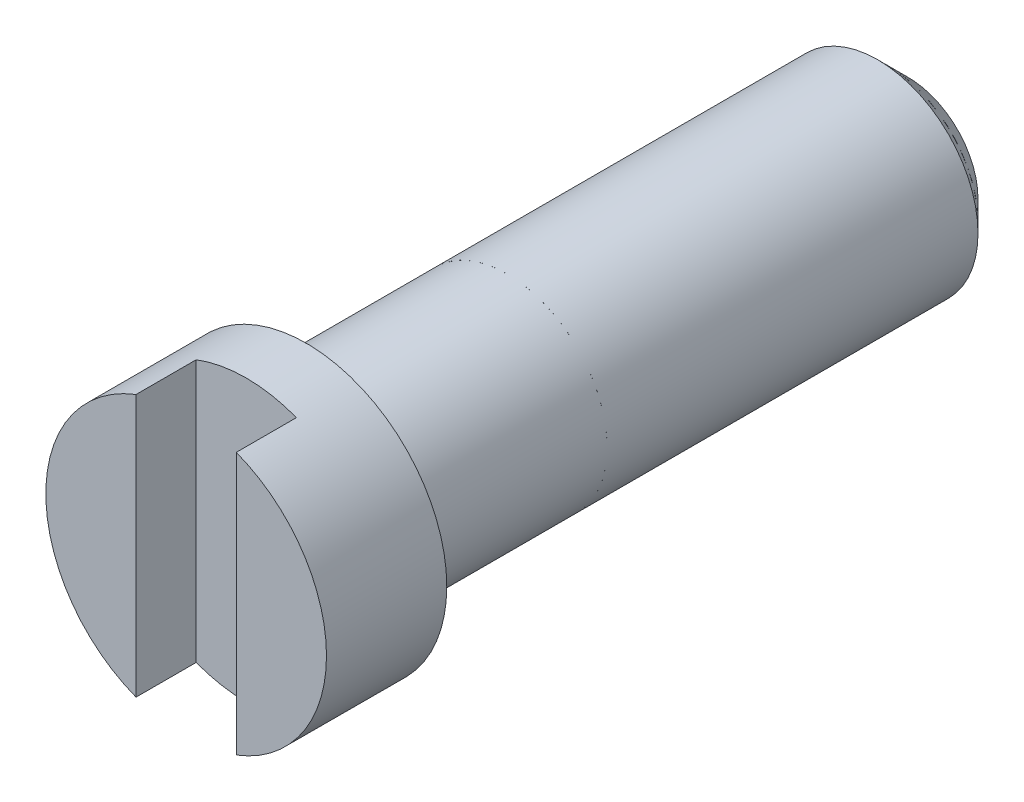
ISO-10303-21;
HEADER;
FILE_DESCRIPTION(('STEP AP214'),'2;1');
FILE_NAME('part.step','',(''),(''),'','','');
FILE_SCHEMA(('AUTOMOTIVE_DESIGN { 1 0 10303 214 1 1 1 1 }'));
ENDSEC;
DATA;
#1=APPLICATION_CONTEXT('core data for automotive mechanical design processes');
#2=APPLICATION_PROTOCOL_DEFINITION('international standard','automotive_design',2000,#1);
#3=PRODUCT_CONTEXT('',#1,'mechanical');
#4=PRODUCT('Part','Part','',(#3));
#5=PRODUCT_RELATED_PRODUCT_CATEGORY('part','',(#4));
#6=PRODUCT_DEFINITION_FORMATION('','',#4);
#7=PRODUCT_DEFINITION_CONTEXT('part definition',#1,'design');
#8=PRODUCT_DEFINITION('design','',#6,#7);
#9=PRODUCT_DEFINITION_SHAPE('','',#8);
#10=(LENGTH_UNIT() NAMED_UNIT(*) SI_UNIT(.MILLI.,.METRE.));
#11=(NAMED_UNIT(*) PLANE_ANGLE_UNIT() SI_UNIT($,.RADIAN.));
#12=(NAMED_UNIT(*) SI_UNIT($,.STERADIAN.) SOLID_ANGLE_UNIT());
#13=UNCERTAINTY_MEASURE_WITH_UNIT(LENGTH_MEASURE(1.E-05),#10,'distance_accuracy_value','');
#14=(GEOMETRIC_REPRESENTATION_CONTEXT(3) GLOBAL_UNCERTAINTY_ASSIGNED_CONTEXT((#13)) GLOBAL_UNIT_ASSIGNED_CONTEXT((#10,
#11,#12)) REPRESENTATION_CONTEXT('',''));
#15=CARTESIAN_POINT('',(0.,0.,0.));
#16=DIRECTION('',(0.,0.,1.));
#17=DIRECTION('',(1.,0.,0.));
#18=AXIS2_PLACEMENT_3D('',#15,#16,#17);
#19=CARTESIAN_POINT('',(0.5,1.68,1.2));
#20=DIRECTION('',(1.,0.,0.));
#21=DIRECTION('',(0.,0.,-1.));
#22=AXIS2_PLACEMENT_3D('',#19,#20,#21);
#23=PLANE('',#22);
#24=DIRECTION('',(0.,1.,0.));
#25=VECTOR('',#24,1.);
#26=CARTESIAN_POINT('',(0.5,1.68,0.6));
#27=LINE('',#26,#25);
#28=CARTESIAN_POINT('',(0.5,1.3076696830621,0.6));
#29=VERTEX_POINT('',#28);
#30=CARTESIAN_POINT('',(0.5,-1.3076696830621,0.6));
#31=VERTEX_POINT('',#30);
#32=EDGE_CURVE('P0_E72',#29,#31,#27,.F.);
#33=ORIENTED_EDGE('',*,*,#32,.T.);
#34=DIRECTION('',(0.,0.,-1.));
#35=VECTOR('',#34,1.);
#36=CARTESIAN_POINT('',(0.5,-1.307669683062,1.2));
#37=LINE('',#36,#35);
#38=CARTESIAN_POINT('',(0.5,-1.3076696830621,1.2));
#39=VERTEX_POINT('',#38);
#40=EDGE_CURVE('P0_E34',#39,#31,#37,.T.);
#41=ORIENTED_EDGE('',*,*,#40,.F.);
#42=DIRECTION('',(0.,1.,0.));
#43=VECTOR('',#42,1.);
#44=CARTESIAN_POINT('',(0.5,0.,1.2));
#45=LINE('',#44,#43);
#46=CARTESIAN_POINT('',(0.5,1.3076696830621,1.2));
#47=VERTEX_POINT('',#46);
#48=EDGE_CURVE('P0_E61',#47,#39,#45,.F.);
#49=ORIENTED_EDGE('',*,*,#48,.F.);
#50=DIRECTION('',(0.,0.,-1.));
#51=VECTOR('',#50,1.);
#52=CARTESIAN_POINT('',(0.5,1.307669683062,1.2));
#53=LINE('',#52,#51);
#54=EDGE_CURVE('P0_E65',#29,#47,#53,.F.);
#55=ORIENTED_EDGE('',*,*,#54,.F.);
#56=EDGE_LOOP('',(#33,#41,#49,#55));
#57=FACE_BOUND('',#56,.T.);
#58=ADVANCED_FACE('P0_F16',(#57),#23,.F.);
#59=CARTESIAN_POINT('',(-0.5,1.68,0.6));
#60=DIRECTION('',(-1.,0.,0.));
#61=DIRECTION('',(0.,0.,1.));
#62=AXIS2_PLACEMENT_3D('',#59,#60,#61);
#63=PLANE('',#62);
#64=DIRECTION('',(0.,1.,0.));
#65=VECTOR('',#64,1.);
#66=CARTESIAN_POINT('',(-0.5,1.68,0.6));
#67=LINE('',#66,#65);
#68=CARTESIAN_POINT('',(-0.5,-1.3076696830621,0.6));
#69=VERTEX_POINT('',#68);
#70=CARTESIAN_POINT('',(-0.5,1.3076696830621,0.6));
#71=VERTEX_POINT('',#70);
#72=EDGE_CURVE('P0_E75',#69,#71,#67,.T.);
#73=ORIENTED_EDGE('',*,*,#72,.T.);
#74=DIRECTION('',(0.,0.,1.));
#75=VECTOR('',#74,1.);
#76=CARTESIAN_POINT('',(-0.5,1.307669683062,0.6));
#77=LINE('',#76,#75);
#78=CARTESIAN_POINT('',(-0.5,1.3076696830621,1.2));
#79=VERTEX_POINT('',#78);
#80=EDGE_CURVE('P0_E70',#79,#71,#77,.F.);
#81=ORIENTED_EDGE('',*,*,#80,.F.);
#82=DIRECTION('',(0.,1.,0.));
#83=VECTOR('',#82,1.);
#84=CARTESIAN_POINT('',(-0.5,0.,1.2));
#85=LINE('',#84,#83);
#86=CARTESIAN_POINT('',(-0.5,-1.3076696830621,1.2));
#87=VERTEX_POINT('',#86);
#88=EDGE_CURVE('P0_E73',#87,#79,#85,.T.);
#89=ORIENTED_EDGE('',*,*,#88,.F.);
#90=DIRECTION('',(0.,0.,1.));
#91=VECTOR('',#90,1.);
#92=CARTESIAN_POINT('',(-0.5,-1.307669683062,0.6));
#93=LINE('',#92,#91);
#94=EDGE_CURVE('P0_E78',#69,#87,#93,.T.);
#95=ORIENTED_EDGE('',*,*,#94,.F.);
#96=EDGE_LOOP('',(#73,#81,#89,#95));
#97=FACE_BOUND('',#96,.T.);
#98=ADVANCED_FACE('P0_F174',(#97),#63,.F.);
#99=CARTESIAN_POINT('',(0.,0.,1.2));
#100=DIRECTION('',(0.,0.,1.));
#101=DIRECTION('',(1.,0.,0.));
#102=AXIS2_PLACEMENT_3D('',#99,#100,#101);
#103=PLANE('',#102);
#104=CARTESIAN_POINT('',(0.,0.,1.2));
#105=DIRECTION('',(0.,0.,1.));
#106=DIRECTION('',(1.,0.,0.));
#107=AXIS2_PLACEMENT_3D('',#104,#105,#106);
#108=CIRCLE('',#107,1.4);
#109=EDGE_CURVE('P0_E52',#87,#79,#108,.F.);
#110=ORIENTED_EDGE('',*,*,#109,.F.);
#111=ORIENTED_EDGE('',*,*,#88,.T.);
#112=EDGE_LOOP('',(#110,#111));
#113=FACE_BOUND('',#112,.T.);
#114=ADVANCED_FACE('P0_F165',(#113),#103,.T.);
#115=CARTESIAN_POINT('',(0.,0.,1.2));
#116=DIRECTION('',(0.,0.,1.));
#117=DIRECTION('',(1.,0.,0.));
#118=AXIS2_PLACEMENT_3D('',#115,#116,#117);
#119=PLANE('',#118);
#120=CARTESIAN_POINT('',(0.,0.,1.2));
#121=DIRECTION('',(0.,0.,1.));
#122=DIRECTION('',(1.,0.,0.));
#123=AXIS2_PLACEMENT_3D('',#120,#121,#122);
#124=CIRCLE('',#123,1.4);
#125=EDGE_CURVE('P0_E57',#47,#39,#124,.F.);
#126=ORIENTED_EDGE('',*,*,#125,.F.);
#127=ORIENTED_EDGE('',*,*,#48,.T.);
#128=EDGE_LOOP('',(#126,#127));
#129=FACE_BOUND('',#128,.T.);
#130=ADVANCED_FACE('P0_F59',(#129),#119,.T.);
#131=CARTESIAN_POINT('',(0.5,1.68,0.6));
#132=DIRECTION('',(0.,0.,-1.));
#133=DIRECTION('',(-1.,0.,0.));
#134=AXIS2_PLACEMENT_3D('',#131,#132,#133);
#135=PLANE('',#134);
#136=CARTESIAN_POINT('',(0.,0.,0.6));
#137=DIRECTION('',(0.,0.,1.));
#138=DIRECTION('',(1.,0.,0.));
#139=AXIS2_PLACEMENT_3D('',#136,#137,#138);
#140=CIRCLE('',#139,1.4);
#141=EDGE_CURVE('P0_E62',#31,#69,#140,.F.);
#142=ORIENTED_EDGE('',*,*,#141,.F.);
#143=ORIENTED_EDGE('',*,*,#32,.F.);
#144=CARTESIAN_POINT('',(0.,0.,0.6));
#145=DIRECTION('',(0.,0.,1.));
#146=DIRECTION('',(1.,0.,0.));
#147=AXIS2_PLACEMENT_3D('',#144,#145,#146);
#148=CIRCLE('',#147,1.4);
#149=EDGE_CURVE('P0_E19',#71,#29,#148,.F.);
#150=ORIENTED_EDGE('',*,*,#149,.F.);
#151=ORIENTED_EDGE('',*,*,#72,.F.);
#152=EDGE_LOOP('',(#142,#143,#150,#151));
#153=FACE_BOUND('',#152,.T.);
#154=ADVANCED_FACE('P0_F110',(#153),#135,.F.);
#155=CARTESIAN_POINT('',(0.,0.,-6.));
#156=DIRECTION('',(0.,0.,-1.));
#157=DIRECTION('',(-1.,0.,0.));
#158=AXIS2_PLACEMENT_3D('',#155,#156,#157);
#159=PLANE('',#158);
#160=CARTESIAN_POINT('',(0.,0.,-6.00000000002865));
#161=DIRECTION('',(0.,0.,1.));
#162=DIRECTION('',(1.,0.,0.));
#163=AXIS2_PLACEMENT_3D('',#160,#161,#162);
#164=CIRCLE('',#163,0.699999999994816);
#165=CARTESIAN_POINT('',(0.699999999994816,0.,-6.00000000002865));
#166=VERTEX_POINT('',#165);
#167=EDGE_CURVE('P0_E88',#166,#166,#164,.T.);
#168=ORIENTED_EDGE('',*,*,#167,.F.);
#169=EDGE_LOOP('',(#168));
#170=FACE_BOUND('',#169,.T.);
#171=ADVANCED_FACE('P0_F108',(#170),#159,.T.);
#172=CARTESIAN_POINT('',(0.,0.,0.));
#173=DIRECTION('',(0.,0.,1.));
#174=DIRECTION('',(1.,0.,0.));
#175=AXIS2_PLACEMENT_3D('',#172,#173,#174);
#176=CYLINDRICAL_SURFACE('',#175,1.4);
#177=CARTESIAN_POINT('',(0.,0.,0.));
#178=DIRECTION('',(0.,0.,1.));
#179=DIRECTION('',(1.,0.,0.));
#180=AXIS2_PLACEMENT_3D('',#177,#178,#179);
#181=CIRCLE('',#180,1.4);
#182=CARTESIAN_POINT('',(1.4,0.,0.));
#183=VERTEX_POINT('',#182);
#184=EDGE_CURVE('P0_E85',#183,#183,#181,.T.);
#185=ORIENTED_EDGE('',*,*,#184,.T.);
#186=EDGE_LOOP('',(#185));
#187=FACE_BOUND('',#186,.T.);
#188=ORIENTED_EDGE('',*,*,#40,.T.);
#189=ORIENTED_EDGE('',*,*,#141,.T.);
#190=ORIENTED_EDGE('',*,*,#94,.T.);
#191=ORIENTED_EDGE('',*,*,#109,.T.);
#192=ORIENTED_EDGE('',*,*,#80,.T.);
#193=ORIENTED_EDGE('',*,*,#149,.T.);
#194=ORIENTED_EDGE('',*,*,#54,.T.);
#195=ORIENTED_EDGE('',*,*,#125,.T.);
#196=EDGE_LOOP('',(#188,#189,#190,#191,#192,#193,#194,#195));
#197=FACE_BOUND('',#196,.T.);
#198=ADVANCED_FACE('P0_F66',(#187,#197),#176,.T.);
#199=CARTESIAN_POINT('',(0.,0.,-5.70000000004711));
#200=DIRECTION('',(0.,0.,1.));
#201=DIRECTION('',(1.,0.,0.));
#202=AXIS2_PLACEMENT_3D('',#199,#200,#201);
#203=CONICAL_SURFACE('',#202,0.999999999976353,0.785398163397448);
#204=CARTESIAN_POINT('',(0.,0.,-5.7));
#205=DIRECTION('',(0.,0.,-1.));
#206=DIRECTION('',(-1.,0.,0.));
#207=AXIS2_PLACEMENT_3D('',#204,#205,#206);
#208=CIRCLE('',#207,1.);
#209=CARTESIAN_POINT('',(-1.,0.,-5.7));
#210=VERTEX_POINT('',#209);
#211=EDGE_CURVE('P0_E25',#210,#210,#208,.F.);
#212=ORIENTED_EDGE('',*,*,#211,.F.);
#213=EDGE_LOOP('',(#212));
#214=FACE_BOUND('',#213,.T.);
#215=ORIENTED_EDGE('',*,*,#167,.T.);
#216=EDGE_LOOP('',(#215));
#217=FACE_BOUND('',#216,.T.);
#218=ADVANCED_FACE('P0_F101',(#214,#217),#203,.T.);
#219=CARTESIAN_POINT('',(0.,0.,0.));
#220=DIRECTION('',(0.,0.,1.));
#221=DIRECTION('',(1.,0.,0.));
#222=AXIS2_PLACEMENT_3D('',#219,#220,#221);
#223=PLANE('',#222);
#224=CARTESIAN_POINT('',(0.,0.,0.));
#225=DIRECTION('',(0.,0.,-1.));
#226=DIRECTION('',(-1.,0.,0.));
#227=AXIS2_PLACEMENT_3D('',#224,#225,#226);
#228=CIRCLE('',#227,1.);
#229=CARTESIAN_POINT('',(-1.,0.,0.));
#230=VERTEX_POINT('',#229);
#231=EDGE_CURVE('P0_E11',#230,#230,#228,.T.);
#232=ORIENTED_EDGE('',*,*,#231,.F.);
#233=EDGE_LOOP('',(#232));
#234=FACE_BOUND('',#233,.T.);
#235=ORIENTED_EDGE('',*,*,#184,.F.);
#236=EDGE_LOOP('',(#235));
#237=FACE_BOUND('',#236,.T.);
#238=ADVANCED_FACE('P0_F104',(#234,#237),#223,.F.);
#239=CARTESIAN_POINT('',(0.,0.,0.));
#240=DIRECTION('',(0.,0.,-1.));
#241=DIRECTION('',(-1.,0.,0.));
#242=AXIS2_PLACEMENT_3D('',#239,#240,#241);
#243=CYLINDRICAL_SURFACE('',#242,1.);
#244=ORIENTED_EDGE('',*,*,#211,.T.);
#245=EDGE_LOOP('',(#244));
#246=FACE_BOUND('',#245,.T.);
#247=ORIENTED_EDGE('',*,*,#231,.T.);
#248=EDGE_LOOP('',(#247));
#249=FACE_BOUND('',#248,.T.);
#250=ADVANCED_FACE('P0_F98',(#246,#249),#243,.T.);
#251=CLOSED_SHELL('',(#58,#98,#114,#130,#154,#171,#198,#218,#238,#250));
#252=MANIFOLD_SOLID_BREP('P0_B1',#251);
#253=CARTESIAN_POINT('',(0.,0.,-6.72));
#254=DIRECTION('',(0.,0.,1.));
#255=DIRECTION('',(1.,0.,0.));
#256=AXIS2_PLACEMENT_3D('',#253,#254,#255);
#257=CYLINDRICAL_SURFACE('',#256,0.9);
#258=CARTESIAN_POINT('',(0.,0.,-2.));
#259=DIRECTION('',(0.,0.,1.));
#260=DIRECTION('',(1.,0.,0.));
#261=AXIS2_PLACEMENT_3D('',#258,#259,#260);
#262=CIRCLE('',#261,0.9);
#263=CARTESIAN_POINT('',(0.9,0.,-2.));
#264=VERTEX_POINT('',#263);
#265=EDGE_CURVE('P1_E20',#264,#264,#262,.F.);
#266=ORIENTED_EDGE('',*,*,#265,.T.);
#267=EDGE_LOOP('',(#266));
#268=FACE_BOUND('',#267,.T.);
#269=CARTESIAN_POINT('',(0.,0.,-5.8));
#270=DIRECTION('',(0.,0.,1.));
#271=DIRECTION('',(1.,0.,0.));
#272=AXIS2_PLACEMENT_3D('',#269,#270,#271);
#273=CIRCLE('',#272,0.9);
#274=CARTESIAN_POINT('',(0.9,0.,-5.8));
#275=VERTEX_POINT('',#274);
#276=EDGE_CURVE('P1_E11',#275,#275,#273,.T.);
#277=ORIENTED_EDGE('',*,*,#276,.T.);
#278=EDGE_LOOP('',(#277));
#279=FACE_BOUND('',#278,.T.);
#280=ADVANCED_FACE('P1_F16',(#268,#279),#257,.T.);
#281=CARTESIAN_POINT('',(0.,0.,-2.));
#282=DIRECTION('',(0.,0.,-1.));
#283=DIRECTION('',(-1.,0.,0.));
#284=AXIS2_PLACEMENT_3D('',#281,#282,#283);
#285=PLANE('',#284);
#286=ORIENTED_EDGE('',*,*,#265,.F.);
#287=EDGE_LOOP('',(#286));
#288=FACE_BOUND('',#287,.T.);
#289=CARTESIAN_POINT('',(1.,0.,-2.));
#290=CARTESIAN_POINT('',(0.999797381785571,-0.19098826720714,-2.));
#291=CARTESIAN_POINT('',(0.92978830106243,-0.368094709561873,-2.));
#292=CARTESIAN_POINT('',(0.853846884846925,-0.560208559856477,-2.));
#293=CARTESIAN_POINT('',(0.707106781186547,-0.707106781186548,-2.));
#294=CARTESIAN_POINT('',(0.561111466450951,-0.853259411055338,-2.));
#295=CARTESIAN_POINT('',(0.368094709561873,-0.92978830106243,-2.));
#296=CARTESIAN_POINT('',(0.191266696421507,-0.99989854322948,-2.));
#297=CARTESIAN_POINT('',(0.,-1.,-2.));
#298=CARTESIAN_POINT('',(-0.190220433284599,-1.00010090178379,-2.));
#299=CARTESIAN_POINT('',(-0.368094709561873,-0.92978830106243,-2.));
#300=CARTESIAN_POINT('',(-0.56020855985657,-0.853846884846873,-2.));
#301=CARTESIAN_POINT('',(-0.707106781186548,-0.707106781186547,-2.));
#302=CARTESIAN_POINT('',(-0.853259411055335,-0.561111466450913,-2.));
#303=CARTESIAN_POINT('',(-0.92978830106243,-0.368094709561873,-2.));
#304=CARTESIAN_POINT('',(-0.999796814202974,-0.191523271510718,-2.));
#305=CARTESIAN_POINT('',(-1.,0.,-2.));
#306=B_SPLINE_CURVE_WITH_KNOTS('',2,(#289,#290,#291,#292,#293,#294,#295,#296,#297,#298,#299,
#300,#301,#302,#303,#304,#305),.UNSPECIFIED.,.F.,.F.,(3,2,2,2,2,2,2,2,3),(0.,0.125,0.25,0.375,
0.5,0.625,0.75,0.875,1.),.UNSPECIFIED.);
#307=CARTESIAN_POINT('',(1.,0.,-2.));
#308=VERTEX_POINT('',#307);
#309=CARTESIAN_POINT('',(-1.,0.,-2.));
#310=VERTEX_POINT('',#309);
#311=EDGE_CURVE('P1_E30',#308,#310,#306,.T.);
#312=ORIENTED_EDGE('',*,*,#311,.T.);
#313=CARTESIAN_POINT('',(-1.,0.,-2.));
#314=CARTESIAN_POINT('',(-0.999797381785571,0.19098826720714,-2.));
#315=CARTESIAN_POINT('',(-0.92978830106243,0.368094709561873,-2.));
#316=CARTESIAN_POINT('',(-0.853846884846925,0.560208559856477,-2.));
#317=CARTESIAN_POINT('',(-0.707106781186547,0.707106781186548,-2.));
#318=CARTESIAN_POINT('',(-0.561111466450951,0.853259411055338,-2.));
#319=CARTESIAN_POINT('',(-0.368094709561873,0.92978830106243,-2.));
#320=CARTESIAN_POINT('',(-0.191266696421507,0.99989854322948,-2.));
#321=CARTESIAN_POINT('',(0.,1.,-2.));
#322=CARTESIAN_POINT('',(0.190220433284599,1.00010090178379,-2.));
#323=CARTESIAN_POINT('',(0.368094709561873,0.92978830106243,-2.));
#324=CARTESIAN_POINT('',(0.56020855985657,0.853846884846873,-2.));
#325=CARTESIAN_POINT('',(0.707106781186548,0.707106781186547,-2.));
#326=CARTESIAN_POINT('',(0.853259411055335,0.561111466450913,-2.));
#327=CARTESIAN_POINT('',(0.92978830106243,0.368094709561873,-2.));
#328=CARTESIAN_POINT('',(0.999796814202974,0.191523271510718,-2.));
#329=CARTESIAN_POINT('',(1.,0.,-2.));
#330=B_SPLINE_CURVE_WITH_KNOTS('',2,(#313,#314,#315,#316,#317,#318,#319,#320,#321,#322,#323,
#324,#325,#326,#327,#328,#329),.UNSPECIFIED.,.F.,.F.,(3,2,2,2,2,2,2,2,3),(0.,0.125,0.25,0.375,
0.5,0.625,0.75,0.875,1.),.UNSPECIFIED.);
#331=EDGE_CURVE('P1_E33',#310,#308,#330,.T.);
#332=ORIENTED_EDGE('',*,*,#331,.T.);
#333=EDGE_LOOP('',(#312,#332));
#334=FACE_BOUND('',#333,.T.);
#335=ADVANCED_FACE('P1_F17',(#288,#334),#285,.T.);
#336=OPEN_SHELL('',(#280,#335));
#337=SHELL_BASED_SURFACE_MODEL('P1_B1',(#336));
#338=ADVANCED_BREP_SHAPE_REPRESENTATION('',(#18,#252),#14);
#339=MANIFOLD_SURFACE_SHAPE_REPRESENTATION('',(#18,#337),#14);
#340=SHAPE_REPRESENTATION('',(#18),#14);
#341=SHAPE_DEFINITION_REPRESENTATION(#9,#340);
#342=SHAPE_REPRESENTATION_RELATIONSHIP('','',#340,#338);
#343=SHAPE_REPRESENTATION_RELATIONSHIP('','',#340,#339);
ENDSEC;
END-ISO-10303-21;
